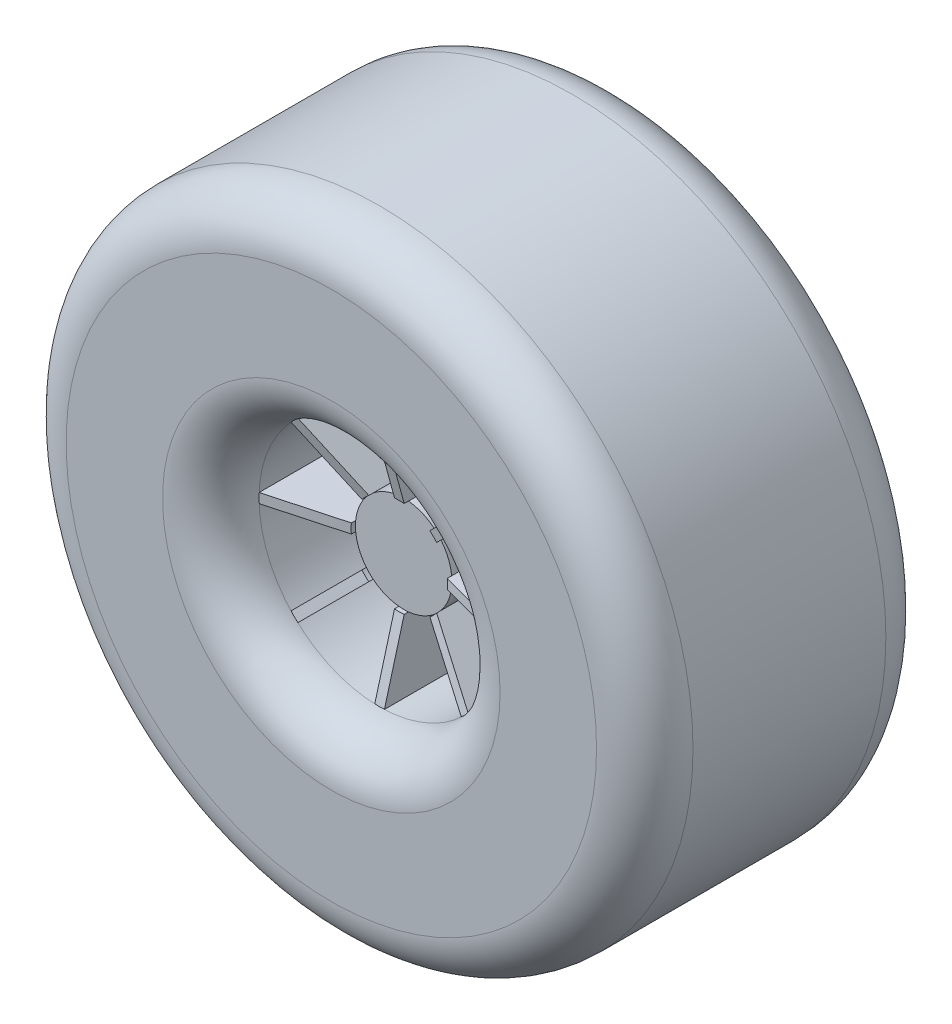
from build123d import *
from build123d.topology import SkipClean

# Parameters (mm, degrees)
SKETCH_1_R               = 65
EXTRUDE_1_DEPTH          = 30
SKETCH_4_R               = 25
CUT_EXTRUDE_1_DEPTH      = 60
FILLET_1_R               = 10
SKETCH_6_R               = 10
EXTRUDE_2_DEPTH          = 15
EXTRUDE_4_DEPTH          = 1
PATTERN_CIRCULAR_1_COUNT = 8
CUT_EXTRUDE_START        = 2
SKETCH_8_R               = 10
CUT_EXTRUDE_2_DEPTH      = 2
SKETCH_9_R               = 10
CUT_EXTRUDE_3_DEPTH      = 2
CUT_EXTRUDE_4_DEPTH      = 6


with BuildPart() as part:
    # Sketch 1 → Extrude 1 (new, symmetric)
    with BuildSketch(Plane.XY):
        Circle(SKETCH_1_R)
    extrude(amount=EXTRUDE_1_DEPTH, both=True)

    # Sketch 4 → Cut-Extrude 1 (cut)
    with BuildSketch(Plane.XY.offset(30)):
        Circle(SKETCH_4_R)
    extrude(amount=-CUT_EXTRUDE_1_DEPTH, mode=Mode.SUBTRACT)

    # Fillet 1
    fillet_1_edges = [part.edges().sort_by_distance(p)[0] for p in [
        (-65, 0, -30),
        (-65, 0, 30),
        (-25, 0, -30),
        (-25, 0, 30),
    ]]
    fillet(fillet_1_edges, radius=FILLET_1_R)



with BuildPart() as body_2:
    # Sketch 6 → Extrude 2 (new, symmetric)
    with BuildSketch(Plane.XY):
        Circle(SKETCH_6_R)
    extrude(amount=EXTRUDE_2_DEPTH, both=True)


with BuildPart() as part_1:
    with SkipClean():  # the faces are left unmerged after this step: merging them gives an invalid solid
        add(part.part)

        add(body_2.part)  # Extrude 4 merges body 2
        # Sketch 7 → Extrude 4 (add, symmetric)
        with BuildSketch(Plane(origin=(0, 0, 0), x_dir=(1, 0, 0), z_dir=(0, 1, 0))):
            Polygon((-6.666679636, 13.529618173), (-6.666679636, -13.529618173), (-6.666679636, -15), (-10.256081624, -15.978928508), (-22.377234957, -19.284699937), (-25, -20), (-25, -17.279618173), (-25, 17.279618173), (-25, 20), (-22.377234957, 19.284699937), (-10.256081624, 15.978928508), (-6.666679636, 15), align=None)
        extrude_4 = extrude(amount=EXTRUDE_4_DEPTH, both=True)

    # Pattern Circular 1: Extrude 4 ×8 about axis
    pattern_circular_1_axis = Axis((0, 0, 0), (0, 0, 1))
    for i in range(1, PATTERN_CIRCULAR_1_COUNT):
        add(extrude_4.rotate(pattern_circular_1_axis, i * 360 / PATTERN_CIRCULAR_1_COUNT))

    # Sketch 8 → Cut-Extrude 2 (cut)
    with BuildSketch(Plane.XY.offset(15).offset(CUT_EXTRUDE_START)):
        Circle(SKETCH_8_R)
    extrude(amount=-CUT_EXTRUDE_2_DEPTH, mode=Mode.SUBTRACT)

    # Sketch 9 → Cut-Extrude 3 (cut)
    with BuildSketch(Plane(origin=(0, 0, -15), x_dir=(-1, 0, 0), z_dir=(0, 0, -1))):
        Circle(SKETCH_9_R)
    extrude(amount=CUT_EXTRUDE_3_DEPTH, mode=Mode.SUBTRACT)

    # Sketch 10 → Cut-Extrude 4 (cut)
    with BuildSketch(Plane(origin=(0, 0, -15), x_dir=(-1, 0, 0), z_dir=(0, 0, -1))):
        Polygon((0, 7.909698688), (-6.85, 3.954849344), (-6.85, -3.954849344), (0, -7.909698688), (6.85, -3.954849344), (6.85, 3.954849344), align=None)
    extrude(amount=-CUT_EXTRUDE_4_DEPTH, mode=Mode.SUBTRACT)


solid = part_1.part
